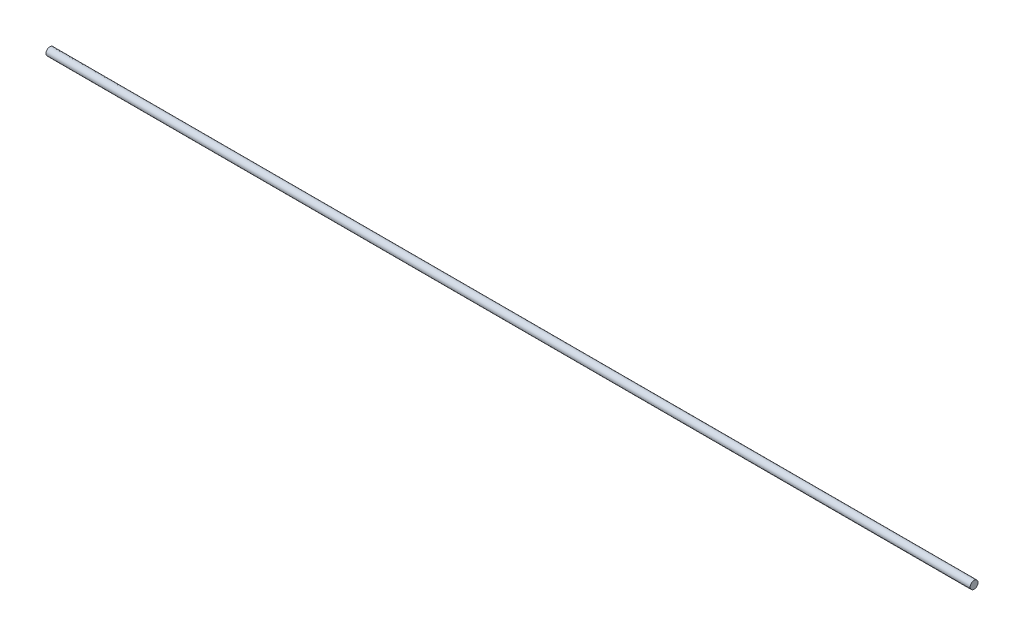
from build123d import *

# Parameters (mm, degrees)
SKETCH1_R             = 14.3256
N9_2_257IN_11FT_DEPTH = 1690.35


with BuildPart() as part:
    # Sketch1 → N9 - 2.257in - 11ft (new, symmetric)
    with BuildSketch(Plane.YZ):
        with Locations(Location((0, 0, 0), (0, 0, 90))):
            Circle(SKETCH1_R)
    extrude(amount=N9_2_257IN_11FT_DEPTH, both=True)


solid = part.part
